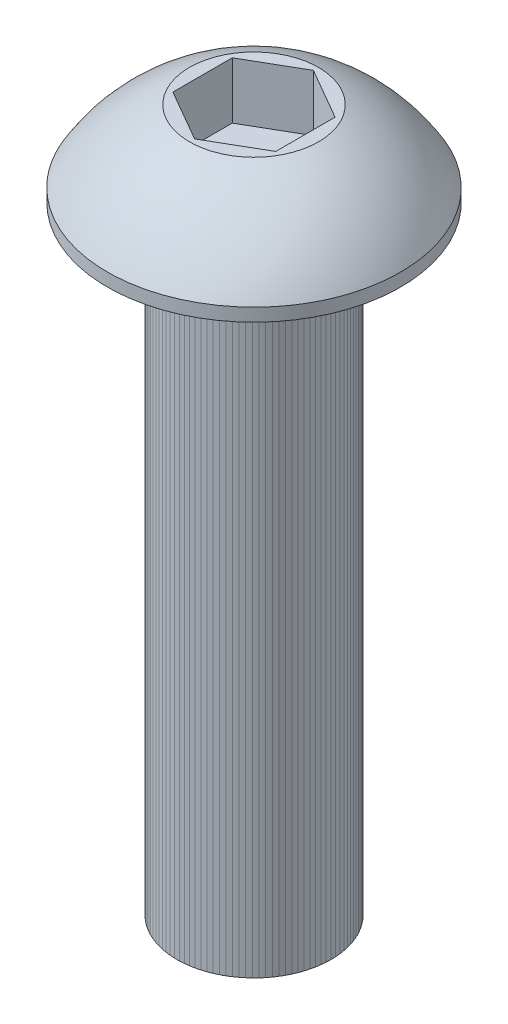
ISO-10303-21;
HEADER;
FILE_DESCRIPTION(('STEP AP214'),'2;1');
FILE_NAME('part.step','',(''),(''),'','','');
FILE_SCHEMA(('AUTOMOTIVE_DESIGN { 1 0 10303 214 1 1 1 1 }'));
ENDSEC;
DATA;
#1=APPLICATION_CONTEXT('core data for automotive mechanical design processes');
#2=APPLICATION_PROTOCOL_DEFINITION('international standard','automotive_design',2000,#1);
#3=PRODUCT_CONTEXT('',#1,'mechanical');
#4=PRODUCT('Part','Part','',(#3));
#5=PRODUCT_RELATED_PRODUCT_CATEGORY('part','',(#4));
#6=PRODUCT_DEFINITION_FORMATION('','',#4);
#7=PRODUCT_DEFINITION_CONTEXT('part definition',#1,'design');
#8=PRODUCT_DEFINITION('design','',#6,#7);
#9=PRODUCT_DEFINITION_SHAPE('','',#8);
#10=(LENGTH_UNIT() NAMED_UNIT(*) SI_UNIT(.MILLI.,.METRE.));
#11=(NAMED_UNIT(*) PLANE_ANGLE_UNIT() SI_UNIT($,.RADIAN.));
#12=(NAMED_UNIT(*) SI_UNIT($,.STERADIAN.) SOLID_ANGLE_UNIT());
#13=UNCERTAINTY_MEASURE_WITH_UNIT(LENGTH_MEASURE(1.E-05),#10,'distance_accuracy_value','');
#14=(GEOMETRIC_REPRESENTATION_CONTEXT(3) GLOBAL_UNCERTAINTY_ASSIGNED_CONTEXT((#13)) GLOBAL_UNIT_ASSIGNED_CONTEXT((#10,
#11,#12)) REPRESENTATION_CONTEXT('',''));
#15=CARTESIAN_POINT('',(0.,0.,0.));
#16=DIRECTION('',(0.,0.,1.));
#17=DIRECTION('',(1.,0.,0.));
#18=AXIS2_PLACEMENT_3D('',#15,#16,#17);
#19=CARTESIAN_POINT('',(0.,-12.,0.));
#20=DIRECTION('',(0.,1.,0.));
#21=DIRECTION('',(0.,0.,1.));
#22=AXIS2_PLACEMENT_3D('',#19,#20,#21);
#23=CYLINDRICAL_SURFACE('',#22,1.5);
#24=CARTESIAN_POINT('',(0.,0.,0.));
#25=DIRECTION('',(0.,1.,0.));
#26=DIRECTION('',(0.,0.,1.));
#27=AXIS2_PLACEMENT_3D('',#24,#25,#26);
#28=CIRCLE('',#27,1.5);
#29=CARTESIAN_POINT('',(0.,0.,1.5));
#30=VERTEX_POINT('',#29);
#31=EDGE_CURVE('P0_E16',#30,#30,#28,.F.);
#32=ORIENTED_EDGE('',*,*,#31,.T.);
#33=EDGE_LOOP('',(#32));
#34=FACE_BOUND('',#33,.T.);
#35=CARTESIAN_POINT('',(0.,-12.,0.));
#36=DIRECTION('',(0.,1.,0.));
#37=DIRECTION('',(0.,0.,1.));
#38=AXIS2_PLACEMENT_3D('',#35,#36,#37);
#39=CIRCLE('',#38,1.5);
#40=CARTESIAN_POINT('',(0.,-12.,1.5));
#41=VERTEX_POINT('',#40);
#42=EDGE_CURVE('P0_E10',#41,#41,#39,.T.);
#43=ORIENTED_EDGE('',*,*,#42,.T.);
#44=EDGE_LOOP('',(#43));
#45=FACE_BOUND('',#44,.T.);
#46=ADVANCED_FACE('P0_F15',(#34,#45),#23,.T.);
#47=OPEN_SHELL('',(#46));
#48=SHELL_BASED_SURFACE_MODEL('P0_B1',(#47));
#49=CARTESIAN_POINT('',(0.,0.55,0.));
#50=DIRECTION('',(0.,1.,0.));
#51=DIRECTION('',(0.,0.,1.));
#52=AXIS2_PLACEMENT_3D('',#49,#50,#51);
#53=PLANE('',#52);
#54=DIRECTION('',(0.866025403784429,0.,0.500000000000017));
#55=VECTOR('',#54,1.);
#56=CARTESIAN_POINT('',(-1.,0.55,0.5773502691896));
#57=LINE('',#56,#55);
#58=CARTESIAN_POINT('',(-1.,0.55,0.5773502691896));
#59=VERTEX_POINT('',#58);
#60=CARTESIAN_POINT('',(0.,0.55,1.15470053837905));
#61=VERTEX_POINT('',#60);
#62=EDGE_CURVE('P1_E78',#59,#61,#57,.T.);
#63=ORIENTED_EDGE('',*,*,#62,.T.);
#64=DIRECTION('',(0.866025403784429,0.,-0.500000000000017));
#65=VECTOR('',#64,1.);
#66=CARTESIAN_POINT('',(0.,0.55,1.154700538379));
#67=LINE('',#66,#65);
#68=CARTESIAN_POINT('',(0.999999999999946,0.55,0.577350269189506));
#69=VERTEX_POINT('',#68);
#70=EDGE_CURVE('P1_E75',#61,#69,#67,.T.);
#71=ORIENTED_EDGE('',*,*,#70,.T.);
#72=DIRECTION('',(0.,0.,-1.));
#73=VECTOR('',#72,1.);
#74=CARTESIAN_POINT('',(1.,0.55,0.5773502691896));
#75=LINE('',#74,#73);
#76=CARTESIAN_POINT('',(1.,0.55,-0.5773502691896));
#77=VERTEX_POINT('',#76);
#78=EDGE_CURVE('P1_E72',#69,#77,#75,.T.);
#79=ORIENTED_EDGE('',*,*,#78,.T.);
#80=DIRECTION('',(-0.866025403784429,0.,-0.500000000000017));
#81=VECTOR('',#80,1.);
#82=CARTESIAN_POINT('',(1.,0.55,-0.5773502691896));
#83=LINE('',#82,#81);
#84=CARTESIAN_POINT('',(0.,0.55,-1.15470053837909));
#85=VERTEX_POINT('',#84);
#86=EDGE_CURVE('P1_E95',#77,#85,#83,.T.);
#87=ORIENTED_EDGE('',*,*,#86,.T.);
#88=DIRECTION('',(-0.866025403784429,0.,0.500000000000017));
#89=VECTOR('',#88,1.);
#90=CARTESIAN_POINT('',(0.,0.55,-1.154700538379));
#91=LINE('',#90,#89);
#92=CARTESIAN_POINT('',(-0.999999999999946,0.55,-0.577350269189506));
#93=VERTEX_POINT('',#92);
#94=EDGE_CURVE('P1_E136',#85,#93,#91,.T.);
#95=ORIENTED_EDGE('',*,*,#94,.T.);
#96=DIRECTION('',(0.,0.,1.));
#97=VECTOR('',#96,1.);
#98=CARTESIAN_POINT('',(-1.,0.55,-0.5773502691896));
#99=LINE('',#98,#97);
#100=EDGE_CURVE('P1_E131',#93,#59,#99,.T.);
#101=ORIENTED_EDGE('',*,*,#100,.T.);
#102=EDGE_LOOP('',(#63,#71,#79,#87,#95,#101));
#103=FACE_BOUND('',#102,.T.);
#104=ADVANCED_FACE('P1_F17',(#103),#53,.T.);
#105=CARTESIAN_POINT('',(0.,1.65,1.154700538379));
#106=DIRECTION('',(0.500000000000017,0.,0.866025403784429));
#107=DIRECTION('',(0.866025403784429,0.,-0.500000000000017));
#108=AXIS2_PLACEMENT_3D('',#105,#106,#107);
#109=PLANE('',#108);
#110=ORIENTED_EDGE('',*,*,#70,.F.);
#111=DIRECTION('',(0.,1.,0.));
#112=VECTOR('',#111,1.);
#113=CARTESIAN_POINT('',(-1.08637057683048E-13,1.65,1.15470053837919));
#114=LINE('',#113,#112);
#115=CARTESIAN_POINT('',(0.,1.65,1.15470053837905));
#116=VERTEX_POINT('',#115);
#117=EDGE_CURVE('P1_E126',#61,#116,#114,.T.);
#118=ORIENTED_EDGE('',*,*,#117,.T.);
#119=DIRECTION('',(0.866025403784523,0.,-0.499999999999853));
#120=VECTOR('',#119,1.);
#121=CARTESIAN_POINT('',(0.,1.65,1.154700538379));
#122=LINE('',#121,#120);
#123=CARTESIAN_POINT('',(0.999999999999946,1.65,0.577350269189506));
#124=VERTEX_POINT('',#123);
#125=EDGE_CURVE('P1_E86',#116,#124,#122,.T.);
#126=ORIENTED_EDGE('',*,*,#125,.T.);
#127=DIRECTION('',(0.,1.,0.));
#128=VECTOR('',#127,1.);
#129=CARTESIAN_POINT('',(1.,1.65,0.5773502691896));
#130=LINE('',#129,#128);
#131=EDGE_CURVE('P1_E81',#124,#69,#130,.F.);
#132=ORIENTED_EDGE('',*,*,#131,.T.);
#133=EDGE_LOOP('',(#110,#118,#126,#132));
#134=FACE_BOUND('',#133,.T.);
#135=ADVANCED_FACE('P1_F84',(#134),#109,.F.);
#136=CARTESIAN_POINT('',(1.,1.65,0.5773502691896));
#137=DIRECTION('',(1.,0.,0.));
#138=DIRECTION('',(0.,0.,-1.));
#139=AXIS2_PLACEMENT_3D('',#136,#137,#138);
#140=PLANE('',#139);
#141=ORIENTED_EDGE('',*,*,#78,.F.);
#142=ORIENTED_EDGE('',*,*,#131,.F.);
#143=DIRECTION('',(0.,0.,-1.));
#144=VECTOR('',#143,1.);
#145=CARTESIAN_POINT('',(1.,1.65,0.));
#146=LINE('',#145,#144);
#147=CARTESIAN_POINT('',(1.,1.65,-0.5773502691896));
#148=VERTEX_POINT('',#147);
#149=EDGE_CURVE('P1_E123',#124,#148,#146,.T.);
#150=ORIENTED_EDGE('',*,*,#149,.T.);
#151=DIRECTION('',(0.,1.,0.));
#152=VECTOR('',#151,1.);
#153=CARTESIAN_POINT('',(1.,1.65,-0.5773502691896));
#154=LINE('',#153,#152);
#155=EDGE_CURVE('P1_E92',#148,#77,#154,.F.);
#156=ORIENTED_EDGE('',*,*,#155,.T.);
#157=EDGE_LOOP('',(#141,#142,#150,#156));
#158=FACE_BOUND('',#157,.T.);
#159=ADVANCED_FACE('P1_F90',(#158),#140,.F.);
#160=CARTESIAN_POINT('',(1.,1.65,-0.5773502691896));
#161=DIRECTION('',(0.500000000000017,0.,-0.866025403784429));
#162=DIRECTION('',(-0.866025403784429,0.,-0.500000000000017));
#163=AXIS2_PLACEMENT_3D('',#160,#161,#162);
#164=PLANE('',#163);
#165=ORIENTED_EDGE('',*,*,#86,.F.);
#166=ORIENTED_EDGE('',*,*,#155,.F.);
#167=DIRECTION('',(-0.866025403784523,0.,-0.499999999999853));
#168=VECTOR('',#167,1.);
#169=CARTESIAN_POINT('',(1.,1.65,-0.5773502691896));
#170=LINE('',#169,#168);
#171=CARTESIAN_POINT('',(0.,1.65,-1.15470053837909));
#172=VERTEX_POINT('',#171);
#173=EDGE_CURVE('P1_E121',#148,#172,#170,.T.);
#174=ORIENTED_EDGE('',*,*,#173,.T.);
#175=DIRECTION('',(0.,1.,0.));
#176=VECTOR('',#175,1.);
#177=CARTESIAN_POINT('',(0.,1.65,-1.154700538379));
#178=LINE('',#177,#176);
#179=EDGE_CURVE('P1_E138',#172,#85,#178,.F.);
#180=ORIENTED_EDGE('',*,*,#179,.T.);
#181=EDGE_LOOP('',(#165,#166,#174,#180));
#182=FACE_BOUND('',#181,.T.);
#183=ADVANCED_FACE('P1_F143',(#182),#164,.F.);
#184=CARTESIAN_POINT('',(0.,1.65,-1.154700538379));
#185=DIRECTION('',(-0.500000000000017,0.,-0.866025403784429));
#186=DIRECTION('',(-0.866025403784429,0.,0.500000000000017));
#187=AXIS2_PLACEMENT_3D('',#184,#185,#186);
#188=PLANE('',#187);
#189=ORIENTED_EDGE('',*,*,#94,.F.);
#190=ORIENTED_EDGE('',*,*,#179,.F.);
#191=DIRECTION('',(-0.866025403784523,0.,0.499999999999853));
#192=VECTOR('',#191,1.);
#193=CARTESIAN_POINT('',(0.,1.65,-1.154700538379));
#194=LINE('',#193,#192);
#195=CARTESIAN_POINT('',(-0.999999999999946,1.65,-0.577350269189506));
#196=VERTEX_POINT('',#195);
#197=EDGE_CURVE('P1_E115',#172,#196,#194,.T.);
#198=ORIENTED_EDGE('',*,*,#197,.T.);
#199=DIRECTION('',(0.,1.,0.));
#200=VECTOR('',#199,1.);
#201=CARTESIAN_POINT('',(-1.,1.65,-0.5773502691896));
#202=LINE('',#201,#200);
#203=EDGE_CURVE('P1_E133',#196,#93,#202,.F.);
#204=ORIENTED_EDGE('',*,*,#203,.T.);
#205=EDGE_LOOP('',(#189,#190,#198,#204));
#206=FACE_BOUND('',#205,.T.);
#207=ADVANCED_FACE('P1_F147',(#206),#188,.F.);
#208=CARTESIAN_POINT('',(-1.,1.65,-0.5773502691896));
#209=DIRECTION('',(-1.,0.,0.));
#210=DIRECTION('',(0.,0.,1.));
#211=AXIS2_PLACEMENT_3D('',#208,#209,#210);
#212=PLANE('',#211);
#213=ORIENTED_EDGE('',*,*,#100,.F.);
#214=ORIENTED_EDGE('',*,*,#203,.F.);
#215=DIRECTION('',(0.,0.,-1.));
#216=VECTOR('',#215,1.);
#217=CARTESIAN_POINT('',(-1.,1.65,0.));
#218=LINE('',#217,#216);
#219=CARTESIAN_POINT('',(-1.,1.65,0.5773502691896));
#220=VERTEX_POINT('',#219);
#221=EDGE_CURVE('P1_E39',#196,#220,#218,.F.);
#222=ORIENTED_EDGE('',*,*,#221,.T.);
#223=DIRECTION('',(0.,1.,0.));
#224=VECTOR('',#223,1.);
#225=CARTESIAN_POINT('',(-1.,1.65,0.5773502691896));
#226=LINE('',#225,#224);
#227=EDGE_CURVE('P1_E129',#220,#59,#226,.F.);
#228=ORIENTED_EDGE('',*,*,#227,.T.);
#229=EDGE_LOOP('',(#213,#214,#222,#228));
#230=FACE_BOUND('',#229,.T.);
#231=ADVANCED_FACE('P1_F149',(#230),#212,.F.);
#232=CARTESIAN_POINT('',(-1.,1.65,0.5773502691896));
#233=DIRECTION('',(-0.500000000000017,0.,0.866025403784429));
#234=DIRECTION('',(0.866025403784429,0.,0.500000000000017));
#235=AXIS2_PLACEMENT_3D('',#232,#233,#234);
#236=PLANE('',#235);
#237=ORIENTED_EDGE('',*,*,#62,.F.);
#238=ORIENTED_EDGE('',*,*,#227,.F.);
#239=DIRECTION('',(0.866025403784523,0.,0.499999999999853));
#240=VECTOR('',#239,1.);
#241=CARTESIAN_POINT('',(-1.,1.65,0.5773502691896));
#242=LINE('',#241,#240);
#243=EDGE_CURVE('P1_E108',#220,#116,#242,.T.);
#244=ORIENTED_EDGE('',*,*,#243,.T.);
#245=ORIENTED_EDGE('',*,*,#117,.F.);
#246=EDGE_LOOP('',(#237,#238,#244,#245));
#247=FACE_BOUND('',#246,.T.);
#248=ADVANCED_FACE('P1_F150',(#247),#236,.F.);
#249=CARTESIAN_POINT('',(0.,1.65,0.));
#250=DIRECTION('',(0.,-1.,0.));
#251=DIRECTION('',(0.,0.,-1.));
#252=AXIS2_PLACEMENT_3D('',#249,#250,#251);
#253=PLANE('',#252);
#254=ORIENTED_EDGE('',*,*,#221,.F.);
#255=ORIENTED_EDGE('',*,*,#197,.F.);
#256=ORIENTED_EDGE('',*,*,#173,.F.);
#257=ORIENTED_EDGE('',*,*,#149,.F.);
#258=ORIENTED_EDGE('',*,*,#125,.F.);
#259=ORIENTED_EDGE('',*,*,#243,.F.);
#260=EDGE_LOOP('',(#254,#255,#256,#257,#258,#259));
#261=FACE_BOUND('',#260,.T.);
#262=CARTESIAN_POINT('',(-1.25470053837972,1.65,0.));
#263=CARTESIAN_POINT('',(-1.2546965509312,1.64999999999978,-0.070424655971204));
#264=CARTESIAN_POINT('',(-1.24873864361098,1.64999999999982,-0.140974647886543));
#265=CARTESIAN_POINT('',(-1.23101016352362,1.65000000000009,-0.245237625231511));
#266=CARTESIAN_POINT('',(-1.22361994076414,1.65000000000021,-0.279775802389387));
#267=CARTESIAN_POINT('',(-1.20595086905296,1.64999999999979,-0.348140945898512));
#268=CARTESIAN_POINT('',(-1.19566967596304,1.64999999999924,-0.381967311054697));
#269=CARTESIAN_POINT('',(-1.16063107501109,1.64999999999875,-0.481845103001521));
#270=CARTESIAN_POINT('',(-1.13164986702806,1.64999999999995,-0.546463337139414));
#271=CARTESIAN_POINT('',(-1.0632361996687,1.65000000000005,-0.669911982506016));
#272=CARTESIAN_POINT('',(-1.02380334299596,1.64999999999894,-0.728742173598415));
#273=CARTESIAN_POINT('',(-0.957707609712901,1.64999999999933,-0.811368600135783));
#274=CARTESIAN_POINT('',(-0.934500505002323,1.6499999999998,-0.837989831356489));
#275=CARTESIAN_POINT('',(-0.885952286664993,1.6500000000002,-0.889159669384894));
#276=CARTESIAN_POINT('',(-0.86061325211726,1.65000000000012,-0.913710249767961));
#277=CARTESIAN_POINT('',(-0.78160082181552,1.64999999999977,-0.984041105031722));
#278=CARTESIAN_POINT('',(-0.724917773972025,1.6499999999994,-1.02651836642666));
#279=CARTESIAN_POINT('',(-0.605255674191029,1.64999999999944,-1.10132851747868));
#280=CARTESIAN_POINT('',(-0.542276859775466,1.64999999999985,-1.13366178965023));
#281=CARTESIAN_POINT('',(-0.411777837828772,1.65000000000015,-1.18730210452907));
#282=CARTESIAN_POINT('',(-0.344257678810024,1.65000000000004,-1.20860926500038));
#283=CARTESIAN_POINT('',(-0.206600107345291,1.64999999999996,-1.23958383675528));
#284=CARTESIAN_POINT('',(-0.136462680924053,1.64999999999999,-1.24925118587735));
#285=CARTESIAN_POINT('',(0.00443971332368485,1.65000000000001,-1.2566745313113));
#286=CARTESIAN_POINT('',(0.075204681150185,1.65,-1.25443052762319));
#287=CARTESIAN_POINT('',(0.21535490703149,1.65,-1.23809206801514));
#288=CARTESIAN_POINT('',(0.284740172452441,1.65,-1.22399767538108));
#289=CARTESIAN_POINT('',(0.42015312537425,1.65,-1.18436674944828));
#290=CARTESIAN_POINT('',(0.486180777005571,1.65,-1.1588300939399));
#291=CARTESIAN_POINT('',(0.613041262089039,1.65,-1.09700781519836));
#292=CARTESIAN_POINT('',(0.673873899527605,1.65,-1.06072178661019));
#293=CARTESIAN_POINT('',(0.759839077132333,1.65,-0.999082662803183));
#294=CARTESIAN_POINT('',(0.787617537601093,1.65,-0.977330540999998));
#295=CARTESIAN_POINT('',(0.8412737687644,1.65,-0.931545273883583));
#296=CARTESIAN_POINT('',(0.867149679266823,1.64999999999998,-0.907509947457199));
#297=CARTESIAN_POINT('',(0.941561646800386,1.65000000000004,-0.832286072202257));
#298=CARTESIAN_POINT('',(0.986957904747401,1.6500000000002,-0.7779250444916));
#299=CARTESIAN_POINT('',(1.06796444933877,1.6499999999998,-0.662348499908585));
#300=CARTESIAN_POINT('',(1.1035751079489,1.64999999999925,-0.601133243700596));
#301=CARTESIAN_POINT('',(1.1489145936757,1.64999999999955,-0.505490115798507));
#302=CARTESIAN_POINT('',(1.16269324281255,1.64999999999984,-0.472931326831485));
#303=CARTESIAN_POINT('',(1.18744810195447,1.65000000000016,-0.406801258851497));
#304=CARTESIAN_POINT('',(1.19842657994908,1.65000000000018,-0.373230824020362));
#305=CARTESIAN_POINT('',(1.22701255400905,1.64999999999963,-0.271407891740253));
#306=CARTESIAN_POINT('',(1.24035065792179,1.64999999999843,-0.201874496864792));
#307=CARTESIAN_POINT('',(1.25006989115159,1.64999999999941,-0.109940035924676));
#308=CARTESIAN_POINT('',(1.25180488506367,1.64999999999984,-0.0879909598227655));
#309=CARTESIAN_POINT('',(1.25412083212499,1.65000000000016,-0.0440320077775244));
#310=CARTESIAN_POINT('',(1.25470178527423,1.65000000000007,-0.0220221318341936));
#311=CARTESIAN_POINT('',(1.2546965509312,1.64999999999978,0.0704246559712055));
#312=CARTESIAN_POINT('',(1.24873864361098,1.64999999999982,0.140974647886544));
#313=CARTESIAN_POINT('',(1.23101016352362,1.65000000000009,0.245237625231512));
#314=CARTESIAN_POINT('',(1.22361994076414,1.65000000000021,0.279775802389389));
#315=CARTESIAN_POINT('',(1.20595086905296,1.64999999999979,0.348140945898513));
#316=CARTESIAN_POINT('',(1.19566967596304,1.64999999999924,0.381967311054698));
#317=CARTESIAN_POINT('',(1.16063107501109,1.64999999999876,0.481845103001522));
#318=CARTESIAN_POINT('',(1.13164986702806,1.64999999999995,0.546463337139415));
#319=CARTESIAN_POINT('',(1.0632361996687,1.65000000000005,0.669911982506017));
#320=CARTESIAN_POINT('',(1.02380334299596,1.64999999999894,0.728742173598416));
#321=CARTESIAN_POINT('',(0.9577076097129,1.64999999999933,0.811368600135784));
#322=CARTESIAN_POINT('',(0.934500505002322,1.6499999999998,0.83798983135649));
#323=CARTESIAN_POINT('',(0.885952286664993,1.6500000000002,0.889159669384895));
#324=CARTESIAN_POINT('',(0.860613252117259,1.65000000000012,0.913710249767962));
#325=CARTESIAN_POINT('',(0.781600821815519,1.64999999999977,0.984041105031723));
#326=CARTESIAN_POINT('',(0.724917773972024,1.6499999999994,1.02651836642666));
#327=CARTESIAN_POINT('',(0.605255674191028,1.64999999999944,1.10132851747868));
#328=CARTESIAN_POINT('',(0.542276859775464,1.64999999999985,1.13366178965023));
#329=CARTESIAN_POINT('',(0.411777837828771,1.65000000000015,1.18730210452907));
#330=CARTESIAN_POINT('',(0.344257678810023,1.65000000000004,1.20860926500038));
#331=CARTESIAN_POINT('',(0.20660010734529,1.64999999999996,1.23958383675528));
#332=CARTESIAN_POINT('',(0.136462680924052,1.64999999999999,1.24925118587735));
#333=CARTESIAN_POINT('',(-0.00443971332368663,1.65000000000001,1.2566745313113));
#334=CARTESIAN_POINT('',(-0.0752046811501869,1.65,1.25443052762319));
#335=CARTESIAN_POINT('',(-0.215354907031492,1.65,1.23809206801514));
#336=CARTESIAN_POINT('',(-0.284740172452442,1.65,1.22399767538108));
#337=CARTESIAN_POINT('',(-0.420153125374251,1.65,1.18436674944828));
#338=CARTESIAN_POINT('',(-0.486180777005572,1.65,1.1588300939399));
#339=CARTESIAN_POINT('',(-0.61304126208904,1.65,1.09700781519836));
#340=CARTESIAN_POINT('',(-0.673873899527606,1.65,1.06072178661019));
#341=CARTESIAN_POINT('',(-0.759839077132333,1.65,0.999082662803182));
#342=CARTESIAN_POINT('',(-0.787617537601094,1.65000000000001,0.977330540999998));
#343=CARTESIAN_POINT('',(-0.8412737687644,1.64999999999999,0.931545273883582));
#344=CARTESIAN_POINT('',(-0.867149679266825,1.64999999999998,0.907509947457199));
#345=CARTESIAN_POINT('',(-0.941561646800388,1.65000000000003,0.832286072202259));
#346=CARTESIAN_POINT('',(-0.986957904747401,1.6500000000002,0.7779250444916));
#347=CARTESIAN_POINT('',(-1.06796444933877,1.6499999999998,0.662348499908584));
#348=CARTESIAN_POINT('',(-1.10357510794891,1.64999999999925,0.601133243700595));
#349=CARTESIAN_POINT('',(-1.1489145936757,1.64999999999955,0.505490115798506));
#350=CARTESIAN_POINT('',(-1.16269324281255,1.64999999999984,0.472931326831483));
#351=CARTESIAN_POINT('',(-1.18744810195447,1.65000000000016,0.406801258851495));
#352=CARTESIAN_POINT('',(-1.19842657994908,1.65000000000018,0.373230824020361));
#353=CARTESIAN_POINT('',(-1.22701255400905,1.64999999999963,0.271407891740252));
#354=CARTESIAN_POINT('',(-1.24035065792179,1.64999999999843,0.20187449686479));
#355=CARTESIAN_POINT('',(-1.25006989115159,1.64999999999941,0.109940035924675));
#356=CARTESIAN_POINT('',(-1.25180488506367,1.64999999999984,0.0879909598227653));
#357=CARTESIAN_POINT('',(-1.25412083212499,1.65000000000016,0.0440320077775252));
#358=CARTESIAN_POINT('',(-1.25470178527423,1.65000000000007,0.0220221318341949));
#359=CARTESIAN_POINT('',(-1.25470053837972,1.65,0.));
#360=B_SPLINE_CURVE_WITH_KNOTS('',3,(#262,#263,#264,#265,#266,#267,#268,#269,#270,#271,#272,
#273,#274,#275,#276,#277,#278,#279,#280,#281,#282,#283,#284,#285,#286,#287,#288,#289,#290,#291,
#292,#293,#294,#295,#296,#297,#298,#299,#300,#301,#302,#303,#304,#305,#306,#307,#308,#309,#310,
#311,#312,#313,#314,#315,#316,#317,#318,#319,#320,#321,#322,#323,#324,#325,#326,#327,#328,#329,
#330,#331,#332,#333,#334,#335,#336,#337,#338,#339,#340,#341,#342,#343,#344,#345,#346,#347,#348,
#349,#350,#351,#352,#353,#354,#355,#356,#357,#358,#359),.UNSPECIFIED.,.T.,.F.,(4,2,2,2,2,2,2,2,
2,2,2,2,2,2,2,2,2,2,2,2,2,2,2,2,2,2,2,2,2,2,2,2,2,2,2,2,2,2,2,2,2,2,2,2,2,2,2,2,4),(0.,
0.211171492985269,0.317034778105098,0.422984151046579,0.634377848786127,0.84577958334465,
0.951618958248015,1.05735628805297,1.26876310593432,1.48016195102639,1.6915585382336,
1.90295625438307,2.1143539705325,2.32575055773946,2.53714940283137,2.74855622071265,
2.85429355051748,2.96013292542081,3.17153465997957,3.38292835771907,3.48887773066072,
3.59474101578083,3.80591250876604,3.87194685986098,3.93798121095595,4.14915270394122,
4.25501598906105,4.36096536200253,4.57235905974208,4.7837607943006,4.88960016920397,
4.99533749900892,5.20674431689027,5.41814316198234,5.62953974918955,5.84093746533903,
6.05233518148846,6.26373176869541,6.47513061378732,6.68653743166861,6.79227476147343,
6.89811413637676,7.10951587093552,7.32090956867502,7.42685894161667,7.53272222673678,
7.74389371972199,7.80992807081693,7.8759624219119),.UNSPECIFIED.);
#361=CARTESIAN_POINT('',(-1.25470053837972,1.65,0.));
#362=VERTEX_POINT('',#361);
#363=EDGE_CURVE('P1_E20',#362,#362,#360,.T.);
#364=ORIENTED_EDGE('',*,*,#363,.F.);
#365=EDGE_LOOP('',(#364));
#366=FACE_BOUND('',#365,.T.);
#367=ADVANCED_FACE('P1_F152',(#261,#366),#253,.F.);
#368=CARTESIAN_POINT('',(0.,-1.39317183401,0.));
#369=DIRECTION('',(-1.,0.,0.));
#370=DIRECTION('',(0.,0.,-1.));
#371=AXIS2_PLACEMENT_3D('',#368,#369,#370);
#372=SPHERICAL_SURFACE('',#371,3.291681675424);
#373=ORIENTED_EDGE('',*,*,#363,.T.);
#374=EDGE_LOOP('',(#373));
#375=FACE_BOUND('',#374,.T.);
#376=CARTESIAN_POINT('',(0.,0.2538461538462,0.));
#377=DIRECTION('',(0.,-1.,0.));
#378=DIRECTION('',(0.,0.,-1.));
#379=AXIS2_PLACEMENT_3D('',#376,#377,#378);
#380=CIRCLE('',#379,2.85);
#381=CARTESIAN_POINT('',(0.,0.2538461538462,-2.85));
#382=VERTEX_POINT('',#381);
#383=EDGE_CURVE('P1_E103',#382,#382,#380,.T.);
#384=ORIENTED_EDGE('',*,*,#383,.F.);
#385=EDGE_LOOP('',(#384));
#386=FACE_BOUND('',#385,.T.);
#387=ADVANCED_FACE('P1_F159',(#375,#386),#372,.T.);
#388=CARTESIAN_POINT('',(0.,1.993435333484,0.));
#389=DIRECTION('',(0.,-1.,0.));
#390=DIRECTION('',(0.,0.,-1.));
#391=AXIS2_PLACEMENT_3D('',#388,#389,#390);
#392=CYLINDRICAL_SURFACE('',#391,2.85);
#393=ORIENTED_EDGE('',*,*,#383,.T.);
#394=EDGE_LOOP('',(#393));
#395=FACE_BOUND('',#394,.T.);
#396=CARTESIAN_POINT('',(0.,0.,0.));
#397=DIRECTION('',(0.,-1.,0.));
#398=DIRECTION('',(0.,0.,-1.));
#399=AXIS2_PLACEMENT_3D('',#396,#397,#398);
#400=CIRCLE('',#399,2.85);
#401=CARTESIAN_POINT('',(0.,0.,-2.85));
#402=VERTEX_POINT('',#401);
#403=EDGE_CURVE('P1_E101',#402,#402,#400,.T.);
#404=ORIENTED_EDGE('',*,*,#403,.F.);
#405=EDGE_LOOP('',(#404));
#406=FACE_BOUND('',#405,.T.);
#407=ADVANCED_FACE('P1_F177',(#395,#406),#392,.T.);
#408=CARTESIAN_POINT('',(0.,-12.,0.));
#409=DIRECTION('',(0.,-1.,0.));
#410=DIRECTION('',(0.,0.,-1.));
#411=AXIS2_PLACEMENT_3D('',#408,#409,#410);
#412=PLANE('',#411);
#413=CARTESIAN_POINT('',(0.,-12.,0.));
#414=DIRECTION('',(0.,-1.,0.));
#415=DIRECTION('',(0.,0.,-1.));
#416=AXIS2_PLACEMENT_3D('',#413,#414,#415);
#417=CIRCLE('',#416,1.5);
#418=CARTESIAN_POINT('',(0.,-12.,-1.5));
#419=VERTEX_POINT('',#418);
#420=EDGE_CURVE('P1_E30',#419,#419,#417,.F.);
#421=ORIENTED_EDGE('',*,*,#420,.F.);
#422=EDGE_LOOP('',(#421));
#423=FACE_BOUND('',#422,.T.);
#424=ADVANCED_FACE('P1_F170',(#423),#412,.T.);
#425=CARTESIAN_POINT('',(0.,0.,0.));
#426=DIRECTION('',(0.,-1.,0.));
#427=DIRECTION('',(0.,0.,-1.));
#428=AXIS2_PLACEMENT_3D('',#425,#426,#427);
#429=PLANE('',#428);
#430=CARTESIAN_POINT('',(0.,0.,0.));
#431=DIRECTION('',(0.,-1.,0.));
#432=DIRECTION('',(0.,0.,-1.));
#433=AXIS2_PLACEMENT_3D('',#430,#431,#432);
#434=CIRCLE('',#433,1.5);
#435=CARTESIAN_POINT('',(0.,0.,-1.5));
#436=VERTEX_POINT('',#435);
#437=EDGE_CURVE('P1_E11',#436,#436,#434,.T.);
#438=ORIENTED_EDGE('',*,*,#437,.F.);
#439=EDGE_LOOP('',(#438));
#440=FACE_BOUND('',#439,.T.);
#441=ORIENTED_EDGE('',*,*,#403,.T.);
#442=EDGE_LOOP('',(#441));
#443=FACE_BOUND('',#442,.T.);
#444=ADVANCED_FACE('P1_F164',(#440,#443),#429,.T.);
#445=CARTESIAN_POINT('',(0.,0.,0.));
#446=DIRECTION('',(0.,-1.,0.));
#447=DIRECTION('',(0.,0.,-1.));
#448=AXIS2_PLACEMENT_3D('',#445,#446,#447);
#449=CYLINDRICAL_SURFACE('',#448,1.5);
#450=ORIENTED_EDGE('',*,*,#420,.T.);
#451=EDGE_LOOP('',(#450));
#452=FACE_BOUND('',#451,.T.);
#453=ORIENTED_EDGE('',*,*,#437,.T.);
#454=EDGE_LOOP('',(#453));
#455=FACE_BOUND('',#454,.T.);
#456=ADVANCED_FACE('P1_F162',(#452,#455),#449,.T.);
#457=CLOSED_SHELL('',(#104,#135,#159,#183,#207,#231,#248,#367,#387,#407,#424,#444,#456));
#458=MANIFOLD_SOLID_BREP('P1_B1',#457);
#459=ADVANCED_BREP_SHAPE_REPRESENTATION('',(#18,#458),#14);
#460=MANIFOLD_SURFACE_SHAPE_REPRESENTATION('',(#18,#48),#14);
#461=SHAPE_REPRESENTATION('',(#18),#14);
#462=SHAPE_DEFINITION_REPRESENTATION(#9,#461);
#463=SHAPE_REPRESENTATION_RELATIONSHIP('','',#461,#459);
#464=SHAPE_REPRESENTATION_RELATIONSHIP('','',#461,#460);
ENDSEC;
END-ISO-10303-21;
